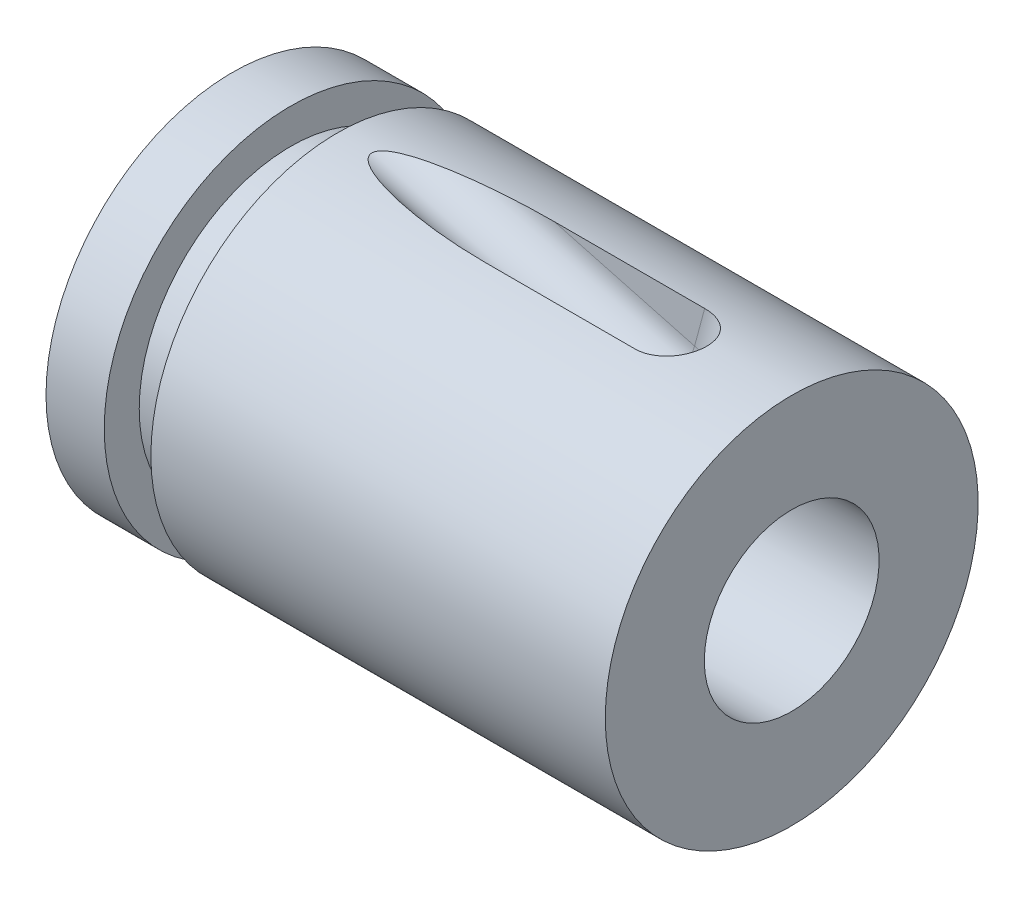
ISO-10303-21;
HEADER;
FILE_DESCRIPTION(('STEP AP214'),'2;1');
FILE_NAME('part.step','',(''),(''),'','','');
FILE_SCHEMA(('AUTOMOTIVE_DESIGN { 1 0 10303 214 1 1 1 1 }'));
ENDSEC;
DATA;
#1=APPLICATION_CONTEXT('core data for automotive mechanical design processes');
#2=APPLICATION_PROTOCOL_DEFINITION('international standard','automotive_design',2000,#1);
#3=PRODUCT_CONTEXT('',#1,'mechanical');
#4=PRODUCT('Part','Part','',(#3));
#5=PRODUCT_RELATED_PRODUCT_CATEGORY('part','',(#4));
#6=PRODUCT_DEFINITION_FORMATION('','',#4);
#7=PRODUCT_DEFINITION_CONTEXT('part definition',#1,'design');
#8=PRODUCT_DEFINITION('design','',#6,#7);
#9=PRODUCT_DEFINITION_SHAPE('','',#8);
#10=(LENGTH_UNIT() NAMED_UNIT(*) SI_UNIT(.MILLI.,.METRE.));
#11=(NAMED_UNIT(*) PLANE_ANGLE_UNIT() SI_UNIT($,.RADIAN.));
#12=(NAMED_UNIT(*) SI_UNIT($,.STERADIAN.) SOLID_ANGLE_UNIT());
#13=UNCERTAINTY_MEASURE_WITH_UNIT(LENGTH_MEASURE(1.E-05),#10,'distance_accuracy_value','');
#14=(GEOMETRIC_REPRESENTATION_CONTEXT(3) GLOBAL_UNCERTAINTY_ASSIGNED_CONTEXT((#13)) GLOBAL_UNIT_ASSIGNED_CONTEXT((#10,
#11,#12)) REPRESENTATION_CONTEXT('',''));
#15=CARTESIAN_POINT('',(0.,0.,0.));
#16=DIRECTION('',(0.,0.,1.));
#17=DIRECTION('',(1.,0.,0.));
#18=AXIS2_PLACEMENT_3D('',#15,#16,#17);
#19=CARTESIAN_POINT('',(-20.0427927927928,0.,0.));
#20=DIRECTION('',(-1.,0.,0.));
#21=DIRECTION('',(0.,0.,1.));
#22=AXIS2_PLACEMENT_3D('',#19,#20,#21);
#23=CYLINDRICAL_SURFACE('',#22,8.);
#24=CARTESIAN_POINT('',(24.,0.,0.));
#25=DIRECTION('',(-1.,0.,0.));
#26=DIRECTION('',(0.,0.,1.));
#27=AXIS2_PLACEMENT_3D('',#24,#25,#26);
#28=CIRCLE('',#27,8.);
#29=CARTESIAN_POINT('',(24.,0.,8.));
#30=VERTEX_POINT('',#29);
#31=EDGE_CURVE('E105',#30,#30,#28,.T.);
#32=ORIENTED_EDGE('',*,*,#31,.T.);
#33=EDGE_LOOP('',(#32));
#34=FACE_BOUND('',#33,.T.);
#35=CARTESIAN_POINT('',(4.5,0.,0.));
#36=DIRECTION('',(-1.,0.,0.));
#37=DIRECTION('',(0.,0.,1.));
#38=AXIS2_PLACEMENT_3D('',#35,#36,#37);
#39=CIRCLE('',#38,8.);
#40=CARTESIAN_POINT('',(4.5,0.,8.));
#41=VERTEX_POINT('',#40);
#42=EDGE_CURVE('E108',#41,#41,#39,.T.);
#43=ORIENTED_EDGE('',*,*,#42,.F.);
#44=EDGE_LOOP('',(#43));
#45=FACE_BOUND('',#44,.T.);
#46=CARTESIAN_POINT('',(12.3114405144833,7.85811682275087,-1.5));
#47=CARTESIAN_POINT('',(12.1870096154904,7.85811686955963,-1.49999650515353));
#48=CARTESIAN_POINT('',(12.0625818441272,7.85831480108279,-1.49896332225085));
#49=CARTESIAN_POINT('',(11.813761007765,7.85909263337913,-1.4948809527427));
#50=CARTESIAN_POINT('',(11.6893679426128,7.85967253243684,-1.49183177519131));
#51=CARTESIAN_POINT('',(11.3161588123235,7.86196523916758,-1.47972130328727));
#52=CARTESIAN_POINT('',(11.0674359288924,7.86423102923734,-1.46769715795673));
#53=CARTESIAN_POINT('',(10.5669115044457,7.87017213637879,-1.43550057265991));
#54=CARTESIAN_POINT('',(10.315117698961,7.8738674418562,-1.41521235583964));
#55=CARTESIAN_POINT('',(9.81247083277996,7.88255454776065,-1.36600429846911));
#56=CARTESIAN_POINT('',(9.56161747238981,7.88754589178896,-1.33708749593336));
#57=CARTESIAN_POINT('',(9.10626058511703,7.89771064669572,-1.27551979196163));
#58=CARTESIAN_POINT('',(8.9015356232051,7.90268984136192,-1.24447596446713));
#59=CARTESIAN_POINT('',(8.493240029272,7.91338588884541,-1.17456279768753));
#60=CARTESIAN_POINT('',(8.28967044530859,7.91910332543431,-1.13568725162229));
#61=CARTESIAN_POINT('',(7.98627922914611,7.92815916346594,-1.06993882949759));
#62=CARTESIAN_POINT('',(7.88563311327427,7.93125247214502,-1.04682575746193));
#63=CARTESIAN_POINT('',(7.68507050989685,7.93758762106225,-0.997658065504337));
#64=CARTESIAN_POINT('',(7.58515394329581,7.94082944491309,-0.971603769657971));
#65=CARTESIAN_POINT('',(7.38644824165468,7.94744008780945,-0.91595848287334));
#66=CARTESIAN_POINT('',(7.28765781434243,7.95080873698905,-0.886372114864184));
#67=CARTESIAN_POINT('',(7.09155604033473,7.95765082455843,-0.822696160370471));
#68=CARTESIAN_POINT('',(6.99424406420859,7.96112421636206,-0.788608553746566));
#69=CARTESIAN_POINT('',(6.84984437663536,7.96638721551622,-0.732816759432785));
#70=CARTESIAN_POINT('',(6.80187431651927,7.96815410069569,-0.713397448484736));
#71=CARTESIAN_POINT('',(6.70672121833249,7.97169404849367,-0.672690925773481));
#72=CARTESIAN_POINT('',(6.65953829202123,7.97346711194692,-0.651403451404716));
#73=CARTESIAN_POINT('',(6.56644503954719,7.97699874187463,-0.606626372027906));
#74=CARTESIAN_POINT('',(6.52053030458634,7.97875733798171,-0.58314611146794));
#75=CARTESIAN_POINT('',(6.43031043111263,7.98224351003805,-0.533300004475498));
#76=CARTESIAN_POINT('',(6.38600523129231,7.98397108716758,-0.506934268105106));
#77=CARTESIAN_POINT('',(6.28543525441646,7.98792512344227,-0.441029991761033));
#78=CARTESIAN_POINT('',(6.23006007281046,7.99012765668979,-0.400018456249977));
#79=CARTESIAN_POINT('',(6.15356603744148,7.9931975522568,-0.330640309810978));
#80=CARTESIAN_POINT('',(6.12905851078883,7.99418615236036,-0.306063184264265));
#81=CARTESIAN_POINT('',(6.08376192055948,7.9960205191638,-0.253660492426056));
#82=CARTESIAN_POINT('',(6.06296276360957,7.99686667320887,-0.225844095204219));
#83=CARTESIAN_POINT('',(6.0343282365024,7.99803489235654,-0.178212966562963));
#84=CARTESIAN_POINT('',(6.0246092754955,7.9984322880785,-0.159544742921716));
#85=CARTESIAN_POINT('',(6.00808360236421,7.99910885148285,-0.120950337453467));
#86=CARTESIAN_POINT('',(6.00127345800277,7.99938815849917,-0.1010256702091));
#87=CARTESIAN_POINT('',(5.99121211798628,7.99980105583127,-0.0600472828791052));
#88=CARTESIAN_POINT('',(5.98799858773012,7.99993310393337,-0.0389839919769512));
#89=CARTESIAN_POINT('',(5.98570701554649,8.00002725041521,0.00336573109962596));
#90=CARTESIAN_POINT('',(5.98662673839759,7.99998944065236,0.0246520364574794));
#91=CARTESIAN_POINT('',(5.99212672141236,7.99976355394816,0.0642817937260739));
#92=CARTESIAN_POINT('',(5.99628391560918,7.99959284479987,0.0826870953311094));
#93=CARTESIAN_POINT('',(6.00731968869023,7.99914025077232,0.118656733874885));
#94=CARTESIAN_POINT('',(6.01420055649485,7.99885827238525,0.136220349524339));
#95=CARTESIAN_POINT('',(6.03483609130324,7.9980140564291,0.180286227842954));
#96=CARTESIAN_POINT('',(6.05025650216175,7.99738439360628,0.206000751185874));
#97=CARTESIAN_POINT('',(6.0847980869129,7.99597894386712,0.254791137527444));
#98=CARTESIAN_POINT('',(6.10392990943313,7.99520273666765,0.277859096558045));
#99=CARTESIAN_POINT('',(6.16406021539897,7.99277312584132,0.342693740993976));
#100=CARTESIAN_POINT('',(6.20847069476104,7.99099082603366,0.381241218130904));
#101=CARTESIAN_POINT('',(6.3018047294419,7.98728012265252,0.452339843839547));
#102=CARTESIAN_POINT('',(6.35074407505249,7.98535121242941,0.484868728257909));
#103=CARTESIAN_POINT('',(6.44518634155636,7.98166607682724,0.541958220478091));
#104=CARTESIAN_POINT('',(6.49039769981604,7.97991687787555,0.567006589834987));
#105=CARTESIAN_POINT('',(6.58217238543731,7.97639910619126,0.614509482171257));
#106=CARTESIAN_POINT('',(6.62873643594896,7.97463052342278,0.636962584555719));
#107=CARTESIAN_POINT('',(6.77000553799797,7.9693173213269,0.70132391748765));
#108=CARTESIAN_POINT('',(6.86611546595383,7.96577198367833,0.740136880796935));
#109=CARTESIAN_POINT('',(7.06132258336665,7.95872429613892,0.812415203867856));
#110=CARTESIAN_POINT('',(7.16043975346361,7.95522270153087,0.845824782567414));
#111=CARTESIAN_POINT('',(7.35990612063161,7.94833974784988,0.908228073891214));
#112=CARTESIAN_POINT('',(7.46025354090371,7.9449582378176,0.93722749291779));
#113=CARTESIAN_POINT('',(7.6616966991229,7.93834087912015,0.991712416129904));
#114=CARTESIAN_POINT('',(7.76279075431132,7.93510477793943,1.01720418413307));
#115=CARTESIAN_POINT('',(7.96566712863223,7.92878781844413,1.06532113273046));
#116=CARTESIAN_POINT('',(8.06744950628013,7.92570697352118,1.08794606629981));
#117=CARTESIAN_POINT('',(8.37364893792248,7.91671473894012,1.15217919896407));
#118=CARTESIAN_POINT('',(8.57884346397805,7.91105611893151,1.1901262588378));
#119=CARTESIAN_POINT('',(8.99105421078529,7.90047916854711,1.25841448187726));
#120=CARTESIAN_POINT('',(9.19807386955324,7.89556289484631,1.28873466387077));
#121=CARTESIAN_POINT('',(9.61294277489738,7.88655590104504,1.34275280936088));
#122=CARTESIAN_POINT('',(9.82079183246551,7.88246500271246,1.36645220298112));
#123=CARTESIAN_POINT('',(10.2190456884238,7.87548627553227,1.4060873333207));
#124=CARTESIAN_POINT('',(10.4094005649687,7.87252489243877,1.42251802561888));
#125=CARTESIAN_POINT('',(10.7904783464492,7.86738874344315,1.45065422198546));
#126=CARTESIAN_POINT('',(10.9812012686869,7.86521401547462,1.46235949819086));
#127=CARTESIAN_POINT('',(11.3617918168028,7.86170919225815,1.48108854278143));
#128=CARTESIAN_POINT('',(11.5516581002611,7.8603743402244,1.48813868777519));
#129=CARTESIAN_POINT('',(11.9314953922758,7.85857831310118,1.49758190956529));
#130=CARTESIAN_POINT('',(12.1214663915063,7.85811706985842,1.49997534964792));
#131=CARTESIAN_POINT('',(12.3114405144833,7.85811682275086,1.5));
#132=B_SPLINE_CURVE_WITH_KNOTS('',3,(#46,#47,#48,#49,#50,#51,#52,#53,#54,#55,#56,#57,#58,#59,
#60,#61,#62,#63,#64,#65,#66,#67,#68,#69,#70,#71,#72,#73,#74,#75,#76,#77,#78,#79,#80,#81,#82,#83,
#84,#85,#86,#87,#88,#89,#90,#91,#92,#93,#94,#95,#96,#97,#98,#99,#100,#101,#102,#103,#104,#105,
#106,#107,#108,#109,#110,#111,#112,#113,#114,#115,#116,#117,#118,#119,#120,#121,#122,#123,#124,
#125,#126,#127,#128,#129,#130,#131),.UNSPECIFIED.,.F.,.F.,(4,2,2,2,2,2,2,2,2,2,2,2,2,2,2,2,2,2,
2,2,2,2,2,2,2,2,2,2,2,2,2,2,2,2,2,2,2,2,2,2,2,2,4),(0.,0.373282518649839,0.74656336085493,
1.49349421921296,2.25127038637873,3.0087800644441,3.63004344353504,4.25180113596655,
4.56170459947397,4.87157394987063,5.18104208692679,5.4903745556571,5.64568876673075,
5.8010248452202,5.95572679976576,6.11042285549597,6.31627065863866,6.42022474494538,
6.52389142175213,6.58685490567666,6.64974388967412,6.71328548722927,6.77679272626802,
6.83316171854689,6.88957818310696,6.97902808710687,7.06873853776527,7.24425648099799,
7.42041126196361,7.57544429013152,7.73056178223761,8.04138775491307,8.35524185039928,
8.66868632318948,8.98156358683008,9.29446779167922,9.92050800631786,10.548252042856,
11.1758603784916,11.7490564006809,12.3222800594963,12.8922272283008,13.4621299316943),.UNSPECIFIED.);
#133=CARTESIAN_POINT('',(12.3114405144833,7.85811682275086,-1.5));
#134=VERTEX_POINT('',#133);
#135=CARTESIAN_POINT('',(12.3114405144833,7.85811682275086,1.5));
#136=VERTEX_POINT('',#135);
#137=EDGE_CURVE('E132',#134,#136,#132,.T.);
#138=ORIENTED_EDGE('',*,*,#137,.F.);
#139=DIRECTION('',(-1.,0.,0.));
#140=VECTOR('',#139,1.);
#141=CARTESIAN_POINT('',(-20.0427927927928,7.85811682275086,-1.5));
#142=LINE('',#141,#140);
#143=CARTESIAN_POINT('',(18.7641796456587,7.85811682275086,-1.5));
#144=VERTEX_POINT('',#143);
#145=EDGE_CURVE('E129',#144,#134,#142,.T.);
#146=ORIENTED_EDGE('',*,*,#145,.F.);
#147=CARTESIAN_POINT('',(18.7641796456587,7.85811682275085,-1.5));
#148=CARTESIAN_POINT('',(18.8557549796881,7.85806391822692,-1.50004318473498));
#149=CARTESIAN_POINT('',(18.9472461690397,7.85960961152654,-1.49217922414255));
#150=CARTESIAN_POINT('',(19.1274794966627,7.86540628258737,-1.46144138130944));
#151=CARTESIAN_POINT('',(19.216224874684,7.8696539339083,-1.4385859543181));
#152=CARTESIAN_POINT('',(19.388582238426,7.88036235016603,-1.37867993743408));
#153=CARTESIAN_POINT('',(19.4721966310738,7.88682206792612,-1.34163606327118));
#154=CARTESIAN_POINT('',(19.6321098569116,7.90118072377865,-1.25431614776));
#155=CARTESIAN_POINT('',(19.7084064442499,7.90908010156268,-1.20403606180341));
#156=CARTESIAN_POINT('',(19.852392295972,7.92552578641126,-1.0905786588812));
#157=CARTESIAN_POINT('',(19.9199498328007,7.93407945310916,-1.02723463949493));
#158=CARTESIAN_POINT('',(20.0428175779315,7.95069645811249,-0.889505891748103));
#159=CARTESIAN_POINT('',(20.0981292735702,7.95875985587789,-0.815122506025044));
#160=CARTESIAN_POINT('',(20.1917888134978,7.97299667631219,-0.661071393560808));
#161=CARTESIAN_POINT('',(20.230823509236,7.97924224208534,-0.581828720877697));
#162=CARTESIAN_POINT('',(20.2936693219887,7.98952249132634,-0.417447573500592));
#163=CARTESIAN_POINT('',(20.317509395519,7.99356137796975,-0.332320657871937));
#164=CARTESIAN_POINT('',(20.3404232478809,7.99747126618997,-0.205223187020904));
#165=CARTESIAN_POINT('',(20.3459257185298,7.99841655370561,-0.164359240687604));
#166=CARTESIAN_POINT('',(20.3532685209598,7.99968146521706,-0.0823384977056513));
#167=CARTESIAN_POINT('',(20.3551127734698,8.00000175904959,-0.0411820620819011));
#168=CARTESIAN_POINT('',(20.3551113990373,8.,0.));
#169=B_SPLINE_CURVE_WITH_KNOTS('',3,(#147,#148,#149,#150,#151,#152,#153,#154,#155,#156,#157,
#158,#159,#160,#161,#162,#163,#164,#165,#166,#167,#168),.UNSPECIFIED.,.F.,.F.,(4,2,2,2,2,2,2,2,
2,2,4),(0.,0.274256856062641,0.548176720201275,0.821967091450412,1.09584122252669,
1.37345429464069,1.6510336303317,1.91528856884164,2.1790383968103,2.30262458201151,
2.42607824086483),.UNSPECIFIED.);
#170=CARTESIAN_POINT('',(20.3551113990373,8.,0.));
#171=VERTEX_POINT('',#170);
#172=EDGE_CURVE('E11',#144,#171,#169,.T.);
#173=ORIENTED_EDGE('',*,*,#172,.T.);
#174=CARTESIAN_POINT('',(20.3551113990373,8.,0.));
#175=CARTESIAN_POINT('',(20.3551136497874,8.00000178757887,0.0396887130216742));
#176=CARTESIAN_POINT('',(20.3534002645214,7.99970429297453,0.0793569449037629));
#177=CARTESIAN_POINT('',(20.3465817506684,7.99852938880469,0.15838044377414));
#178=CARTESIAN_POINT('',(20.341477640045,7.99765215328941,0.197735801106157));
#179=CARTESIAN_POINT('',(20.3211984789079,7.99418902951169,0.314605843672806));
#180=CARTESIAN_POINT('',(20.3010557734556,7.99077138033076,0.391289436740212));
#181=CARTESIAN_POINT('',(20.2484395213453,7.98209925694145,0.540055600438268));
#182=CARTESIAN_POINT('',(20.2159746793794,7.97684607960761,0.612141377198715));
#183=CARTESIAN_POINT('',(20.139992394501,7.96505288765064,0.750157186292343));
#184=CARTESIAN_POINT('',(20.096467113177,7.95851196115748,0.816082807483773));
#185=CARTESIAN_POINT('',(19.9976338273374,7.94446921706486,0.943234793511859));
#186=CARTESIAN_POINT('',(19.9418786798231,7.93693716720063,1.00410930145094));
#187=CARTESIAN_POINT('',(19.8215981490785,7.9219114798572,1.11648486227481));
#188=CARTESIAN_POINT('',(19.7570690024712,7.91441786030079,1.16798187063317));
#189=CARTESIAN_POINT('',(19.6153056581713,7.89959709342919,1.26449569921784));
#190=CARTESIAN_POINT('',(19.5374628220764,7.89233446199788,1.30862976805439));
#191=CARTESIAN_POINT('',(19.3755947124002,7.87949684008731,1.38382959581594));
#192=CARTESIAN_POINT('',(19.2915713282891,7.87392133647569,1.41489932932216));
#193=CARTESIAN_POINT('',(19.1338674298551,7.86584143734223,1.45910079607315));
#194=CARTESIAN_POINT('',(19.0607949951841,7.86298020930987,1.47435824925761));
#195=CARTESIAN_POINT('',(18.9132260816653,7.85910641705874,1.49481539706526));
#196=CARTESIAN_POINT('',(18.8387298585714,7.85809352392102,1.50001688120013));
#197=CARTESIAN_POINT('',(18.7641796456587,7.85811682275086,1.5));
#198=B_SPLINE_CURVE_WITH_KNOTS('',3,(#174,#175,#176,#177,#178,#179,#180,#181,#182,#183,#184,
#185,#186,#187,#188,#189,#190,#191,#192,#193,#194,#195,#196,#197),.UNSPECIFIED.,.F.,.F.,(4,2,2,
2,2,2,2,2,2,2,2,4),(0.,0.118988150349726,0.237940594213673,0.47476546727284,0.71142335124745,
0.948249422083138,1.19588554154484,1.44362821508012,1.7117705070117,1.97983116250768,
2.20324679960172,2.4266226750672),.UNSPECIFIED.);
#199=CARTESIAN_POINT('',(18.7641796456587,7.85811682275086,1.5));
#200=VERTEX_POINT('',#199);
#201=EDGE_CURVE('E44',#171,#200,#198,.T.);
#202=ORIENTED_EDGE('',*,*,#201,.T.);
#203=DIRECTION('',(-1.,0.,0.));
#204=VECTOR('',#203,1.);
#205=CARTESIAN_POINT('',(-20.0427927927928,7.85811682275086,1.5));
#206=LINE('',#205,#204);
#207=EDGE_CURVE('E126',#136,#200,#206,.F.);
#208=ORIENTED_EDGE('',*,*,#207,.F.);
#209=EDGE_LOOP('',(#138,#146,#173,#202,#208));
#210=FACE_BOUND('',#209,.T.);
#211=ADVANCED_FACE('F31',(#34,#45,#210),#23,.T.);
#212=CARTESIAN_POINT('',(0.,0.,0.));
#213=DIRECTION('',(-1.,0.,0.));
#214=DIRECTION('',(0.,0.,1.));
#215=AXIS2_PLACEMENT_3D('',#212,#213,#214);
#216=CONICAL_SURFACE('',#215,5.75,0.78539816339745);
#217=CARTESIAN_POINT('',(1.99999999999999,0.,0.));
#218=DIRECTION('',(-1.,0.,0.));
#219=DIRECTION('',(0.,0.,1.));
#220=AXIS2_PLACEMENT_3D('',#217,#218,#219);
#221=CIRCLE('',#220,3.75);
#222=CARTESIAN_POINT('',(1.99999999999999,0.,3.75));
#223=VERTEX_POINT('',#222);
#224=EDGE_CURVE('E99',#223,#223,#221,.T.);
#225=ORIENTED_EDGE('',*,*,#224,.F.);
#226=EDGE_LOOP('',(#225));
#227=FACE_BOUND('',#226,.T.);
#228=CARTESIAN_POINT('',(0.,0.,0.));
#229=DIRECTION('',(-1.,0.,0.));
#230=DIRECTION('',(0.,0.,1.));
#231=AXIS2_PLACEMENT_3D('',#228,#229,#230);
#232=CIRCLE('',#231,5.75);
#233=CARTESIAN_POINT('',(0.,0.,5.75));
#234=VERTEX_POINT('',#233);
#235=EDGE_CURVE('E123',#234,#234,#232,.T.);
#236=ORIENTED_EDGE('',*,*,#235,.T.);
#237=EDGE_LOOP('',(#236));
#238=FACE_BOUND('',#237,.T.);
#239=ADVANCED_FACE('F33',(#227,#238),#216,.F.);
#240=CARTESIAN_POINT('',(0.,5.75,0.));
#241=DIRECTION('',(1.,0.,0.));
#242=DIRECTION('',(0.,0.,-1.));
#243=AXIS2_PLACEMENT_3D('',#240,#241,#242);
#244=PLANE('',#243);
#245=ORIENTED_EDGE('',*,*,#235,.F.);
#246=EDGE_LOOP('',(#245));
#247=FACE_BOUND('',#246,.T.);
#248=CARTESIAN_POINT('',(0.,0.,0.));
#249=DIRECTION('',(-1.,0.,0.));
#250=DIRECTION('',(0.,0.,1.));
#251=AXIS2_PLACEMENT_3D('',#248,#249,#250);
#252=CIRCLE('',#251,8.);
#253=CARTESIAN_POINT('',(0.,0.,8.));
#254=VERTEX_POINT('',#253);
#255=EDGE_CURVE('E120',#254,#254,#252,.T.);
#256=ORIENTED_EDGE('',*,*,#255,.T.);
#257=EDGE_LOOP('',(#256));
#258=FACE_BOUND('',#257,.T.);
#259=ADVANCED_FACE('F170',(#247,#258),#244,.F.);
#260=CARTESIAN_POINT('',(-20.0427927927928,0.,0.));
#261=DIRECTION('',(-1.,0.,0.));
#262=DIRECTION('',(0.,0.,1.));
#263=AXIS2_PLACEMENT_3D('',#260,#261,#262);
#264=CYLINDRICAL_SURFACE('',#263,8.);
#265=ORIENTED_EDGE('',*,*,#255,.F.);
#266=EDGE_LOOP('',(#265));
#267=FACE_BOUND('',#266,.T.);
#268=CARTESIAN_POINT('',(2.5,0.,0.));
#269=DIRECTION('',(-1.,0.,0.));
#270=DIRECTION('',(0.,0.,1.));
#271=AXIS2_PLACEMENT_3D('',#268,#269,#270);
#272=CIRCLE('',#271,8.);
#273=CARTESIAN_POINT('',(2.5,0.,8.));
#274=VERTEX_POINT('',#273);
#275=EDGE_CURVE('E117',#274,#274,#272,.T.);
#276=ORIENTED_EDGE('',*,*,#275,.T.);
#277=EDGE_LOOP('',(#276));
#278=FACE_BOUND('',#277,.T.);
#279=ADVANCED_FACE('F263',(#267,#278),#264,.T.);
#280=CARTESIAN_POINT('',(2.5,8.,0.));
#281=DIRECTION('',(-1.,0.,0.));
#282=DIRECTION('',(0.,0.,1.));
#283=AXIS2_PLACEMENT_3D('',#280,#281,#282);
#284=PLANE('',#283);
#285=ORIENTED_EDGE('',*,*,#275,.F.);
#286=EDGE_LOOP('',(#285));
#287=FACE_BOUND('',#286,.T.);
#288=CARTESIAN_POINT('',(2.5,0.,0.));
#289=DIRECTION('',(-1.,0.,0.));
#290=DIRECTION('',(0.,0.,1.));
#291=AXIS2_PLACEMENT_3D('',#288,#289,#290);
#292=CIRCLE('',#291,6.5);
#293=CARTESIAN_POINT('',(2.5,0.,6.5));
#294=VERTEX_POINT('',#293);
#295=EDGE_CURVE('E114',#294,#294,#292,.T.);
#296=ORIENTED_EDGE('',*,*,#295,.T.);
#297=EDGE_LOOP('',(#296));
#298=FACE_BOUND('',#297,.T.);
#299=ADVANCED_FACE('F253',(#287,#298),#284,.F.);
#300=CARTESIAN_POINT('',(-20.0427927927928,0.,0.));
#301=DIRECTION('',(-1.,0.,0.));
#302=DIRECTION('',(0.,0.,1.));
#303=AXIS2_PLACEMENT_3D('',#300,#301,#302);
#304=CYLINDRICAL_SURFACE('',#303,6.5);
#305=ORIENTED_EDGE('',*,*,#295,.F.);
#306=EDGE_LOOP('',(#305));
#307=FACE_BOUND('',#306,.T.);
#308=CARTESIAN_POINT('',(4.5,0.,0.));
#309=DIRECTION('',(-1.,0.,0.));
#310=DIRECTION('',(0.,0.,1.));
#311=AXIS2_PLACEMENT_3D('',#308,#309,#310);
#312=CIRCLE('',#311,6.5);
#313=CARTESIAN_POINT('',(4.5,0.,6.5));
#314=VERTEX_POINT('',#313);
#315=EDGE_CURVE('E111',#314,#314,#312,.T.);
#316=ORIENTED_EDGE('',*,*,#315,.T.);
#317=EDGE_LOOP('',(#316));
#318=FACE_BOUND('',#317,.T.);
#319=ADVANCED_FACE('F161',(#307,#318),#304,.T.);
#320=CARTESIAN_POINT('',(4.5,6.5,0.));
#321=DIRECTION('',(1.,0.,0.));
#322=DIRECTION('',(0.,0.,-1.));
#323=AXIS2_PLACEMENT_3D('',#320,#321,#322);
#324=PLANE('',#323);
#325=ORIENTED_EDGE('',*,*,#315,.F.);
#326=EDGE_LOOP('',(#325));
#327=FACE_BOUND('',#326,.T.);
#328=ORIENTED_EDGE('',*,*,#42,.T.);
#329=EDGE_LOOP('',(#328));
#330=FACE_BOUND('',#329,.T.);
#331=ADVANCED_FACE('F156',(#327,#330),#324,.F.);
#332=CARTESIAN_POINT('',(24.,8.,0.));
#333=DIRECTION('',(-1.,0.,0.));
#334=DIRECTION('',(0.,0.,1.));
#335=AXIS2_PLACEMENT_3D('',#332,#333,#334);
#336=PLANE('',#335);
#337=ORIENTED_EDGE('',*,*,#31,.F.);
#338=EDGE_LOOP('',(#337));
#339=FACE_BOUND('',#338,.T.);
#340=CARTESIAN_POINT('',(24.,0.,0.));
#341=DIRECTION('',(-1.,0.,0.));
#342=DIRECTION('',(0.,0.,1.));
#343=AXIS2_PLACEMENT_3D('',#340,#341,#342);
#344=CIRCLE('',#343,3.75);
#345=CARTESIAN_POINT('',(24.,0.,3.75));
#346=VERTEX_POINT('',#345);
#347=EDGE_CURVE('E102',#346,#346,#344,.T.);
#348=ORIENTED_EDGE('',*,*,#347,.T.);
#349=EDGE_LOOP('',(#348));
#350=FACE_BOUND('',#349,.T.);
#351=ADVANCED_FACE('F153',(#339,#350),#336,.F.);
#352=CARTESIAN_POINT('',(-20.0427927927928,0.,0.));
#353=DIRECTION('',(-1.,0.,0.));
#354=DIRECTION('',(0.,0.,1.));
#355=AXIS2_PLACEMENT_3D('',#352,#353,#354);
#356=CYLINDRICAL_SURFACE('',#355,3.75);
#357=ORIENTED_EDGE('',*,*,#347,.F.);
#358=EDGE_LOOP('',(#357));
#359=FACE_BOUND('',#358,.T.);
#360=ORIENTED_EDGE('',*,*,#224,.T.);
#361=EDGE_LOOP('',(#360));
#362=FACE_BOUND('',#361,.T.);
#363=ADVANCED_FACE('F150',(#359,#362),#356,.F.);
#364=CARTESIAN_POINT('',(19.7808168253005,5.85670347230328,0.));
#365=DIRECTION('',(-0.96592582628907,0.258819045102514,0.));
#366=DIRECTION('',(-0.258819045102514,-0.96592582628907,0.));
#367=AXIS2_PLACEMENT_3D('',#364,#365,#366);
#368=CYLINDRICAL_SURFACE('',#367,1.5);
#369=DIRECTION('',(-0.96592582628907,0.258819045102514,0.));
#370=VECTOR('',#369,1.);
#371=CARTESIAN_POINT('',(19.7808168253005,5.85670347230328,1.5));
#372=LINE('',#371,#370);
#373=CARTESIAN_POINT('',(18.3319280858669,6.24493203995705,1.5));
#374=VERTEX_POINT('',#373);
#375=EDGE_CURVE('E85',#374,#136,#372,.T.);
#376=ORIENTED_EDGE('',*,*,#375,.F.);
#377=CARTESIAN_POINT('',(18.3319280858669,6.24493203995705,0.));
#378=DIRECTION('',(-0.96592582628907,0.258819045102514,0.));
#379=DIRECTION('',(-0.258819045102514,-0.96592582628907,0.));
#380=AXIS2_PLACEMENT_3D('',#377,#378,#379);
#381=CIRCLE('',#380,1.5);
#382=CARTESIAN_POINT('',(18.3319280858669,6.24493203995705,-1.5));
#383=VERTEX_POINT('',#382);
#384=EDGE_CURVE('E57',#374,#383,#381,.F.);
#385=ORIENTED_EDGE('',*,*,#384,.T.);
#386=DIRECTION('',(-0.96592582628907,0.258819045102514,0.));
#387=VECTOR('',#386,1.);
#388=CARTESIAN_POINT('',(19.7808168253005,5.85670347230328,-1.5));
#389=LINE('',#388,#387);
#390=EDGE_CURVE('E97',#383,#134,#389,.T.);
#391=ORIENTED_EDGE('',*,*,#390,.T.);
#392=ORIENTED_EDGE('',*,*,#137,.T.);
#393=EDGE_LOOP('',(#376,#385,#391,#392));
#394=FACE_BOUND('',#393,.T.);
#395=ADVANCED_FACE('F144',(#394),#368,.F.);
#396=CARTESIAN_POINT('',(19.7808168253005,5.85670347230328,-1.5));
#397=DIRECTION('',(0.,0.,1.));
#398=DIRECTION('',(1.,0.,0.));
#399=AXIS2_PLACEMENT_3D('',#396,#397,#398);
#400=PLANE('',#399);
#401=ORIENTED_EDGE('',*,*,#390,.F.);
#402=DIRECTION('',(0.258819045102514,0.96592582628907,0.));
#403=VECTOR('',#402,1.);
#404=CARTESIAN_POINT('',(18.3319280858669,6.24493203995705,-1.5));
#405=LINE('',#404,#403);
#406=EDGE_CURVE('E82',#383,#144,#405,.T.);
#407=ORIENTED_EDGE('',*,*,#406,.T.);
#408=ORIENTED_EDGE('',*,*,#145,.T.);
#409=EDGE_LOOP('',(#401,#407,#408));
#410=FACE_BOUND('',#409,.T.);
#411=ADVANCED_FACE('F149',(#410),#400,.T.);
#412=CARTESIAN_POINT('',(19.7808168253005,5.85670347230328,1.5));
#413=DIRECTION('',(0.,0.,-1.));
#414=DIRECTION('',(-1.,0.,0.));
#415=AXIS2_PLACEMENT_3D('',#412,#413,#414);
#416=PLANE('',#415);
#417=ORIENTED_EDGE('',*,*,#207,.T.);
#418=DIRECTION('',(-0.258819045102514,-0.96592582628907,0.));
#419=VECTOR('',#418,1.);
#420=CARTESIAN_POINT('',(18.3319280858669,6.24493203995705,1.5));
#421=LINE('',#420,#419);
#422=EDGE_CURVE('E139',#200,#374,#421,.T.);
#423=ORIENTED_EDGE('',*,*,#422,.T.);
#424=ORIENTED_EDGE('',*,*,#375,.T.);
#425=EDGE_LOOP('',(#417,#423,#424));
#426=FACE_BOUND('',#425,.T.);
#427=ADVANCED_FACE('F188',(#426),#416,.T.);
#428=CARTESIAN_POINT('',(18.3319280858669,6.24493203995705,0.));
#429=DIRECTION('',(0.258819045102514,0.96592582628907,0.));
#430=DIRECTION('',(-0.96592582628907,0.258819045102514,0.));
#431=AXIS2_PLACEMENT_3D('',#428,#429,#430);
#432=CYLINDRICAL_SURFACE('',#431,1.5);
#433=ORIENTED_EDGE('',*,*,#172,.F.);
#434=ORIENTED_EDGE('',*,*,#406,.F.);
#435=CARTESIAN_POINT('',(18.3319280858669,6.24493203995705,0.));
#436=DIRECTION('',(0.258819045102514,0.96592582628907,0.));
#437=DIRECTION('',(-0.96592582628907,0.258819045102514,0.));
#438=AXIS2_PLACEMENT_3D('',#435,#436,#437);
#439=CIRCLE('',#438,1.5);
#440=CARTESIAN_POINT('',(19.7808168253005,5.85670347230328,0.));
#441=VERTEX_POINT('',#440);
#442=EDGE_CURVE('E77',#441,#383,#439,.T.);
#443=ORIENTED_EDGE('',*,*,#442,.F.);
#444=DIRECTION('',(0.258819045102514,0.96592582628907,0.));
#445=VECTOR('',#444,1.);
#446=CARTESIAN_POINT('',(19.7808168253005,5.85670347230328,0.));
#447=LINE('',#446,#445);
#448=EDGE_CURVE('E80',#171,#441,#447,.F.);
#449=ORIENTED_EDGE('',*,*,#448,.F.);
#450=EDGE_LOOP('',(#433,#434,#443,#449));
#451=FACE_BOUND('',#450,.T.);
#452=ADVANCED_FACE('F79',(#451),#432,.F.);
#453=CARTESIAN_POINT('',(18.3319280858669,6.24493203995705,0.));
#454=DIRECTION('',(0.,0.,1.));
#455=DIRECTION('',(1.,0.,0.));
#456=AXIS2_PLACEMENT_3D('',#453,#454,#455);
#457=SPHERICAL_SURFACE('',#456,1.5);
#458=ORIENTED_EDGE('',*,*,#442,.T.);
#459=ORIENTED_EDGE('',*,*,#384,.F.);
#460=CARTESIAN_POINT('',(18.3319280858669,6.24493203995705,0.));
#461=DIRECTION('',(-0.258819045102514,-0.96592582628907,0.));
#462=DIRECTION('',(0.96592582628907,-0.258819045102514,0.));
#463=AXIS2_PLACEMENT_3D('',#460,#461,#462);
#464=CIRCLE('',#463,1.5);
#465=EDGE_CURVE('E90',#441,#374,#464,.T.);
#466=ORIENTED_EDGE('',*,*,#465,.F.);
#467=EDGE_LOOP('',(#458,#459,#466));
#468=FACE_BOUND('',#467,.T.);
#469=ADVANCED_FACE('F92',(#468),#457,.F.);
#470=CARTESIAN_POINT('',(18.3319280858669,6.24493203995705,0.));
#471=DIRECTION('',(-0.258819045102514,-0.96592582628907,0.));
#472=DIRECTION('',(0.96592582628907,-0.258819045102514,0.));
#473=AXIS2_PLACEMENT_3D('',#470,#471,#472);
#474=CYLINDRICAL_SURFACE('',#473,1.5);
#475=ORIENTED_EDGE('',*,*,#201,.F.);
#476=ORIENTED_EDGE('',*,*,#448,.T.);
#477=ORIENTED_EDGE('',*,*,#465,.T.);
#478=ORIENTED_EDGE('',*,*,#422,.F.);
#479=EDGE_LOOP('',(#475,#476,#477,#478));
#480=FACE_BOUND('',#479,.T.);
#481=ADVANCED_FACE('F88',(#480),#474,.F.);
#482=CLOSED_SHELL('',(#211,#239,#259,#279,#299,#319,#331,#351,#363,#395,#411,#427,#452,#469,#481));
#483=MANIFOLD_SOLID_BREP('B2',#482);
#484=ADVANCED_BREP_SHAPE_REPRESENTATION('',(#18,#483),#14);
#485=SHAPE_DEFINITION_REPRESENTATION(#9,#484);
ENDSEC;
END-ISO-10303-21;
